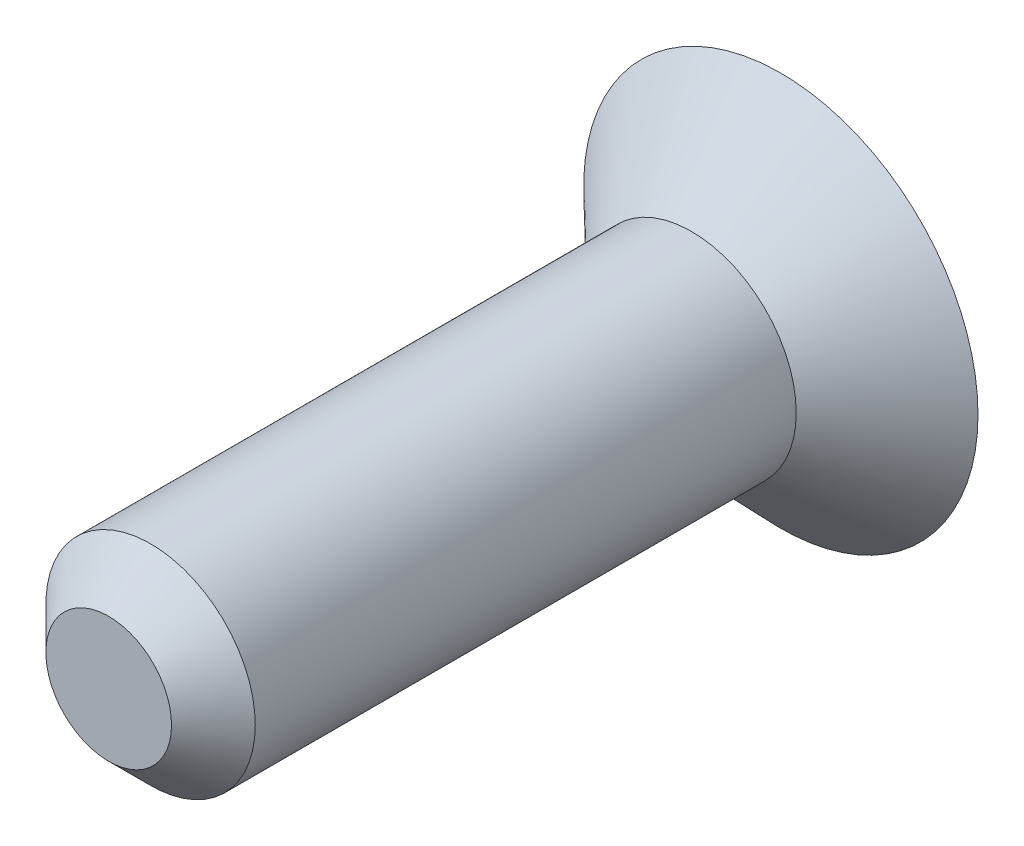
ISO-10303-21;
HEADER;
FILE_DESCRIPTION(('STEP AP214'),'2;1');
FILE_NAME('part.step','',(''),(''),'','','');
FILE_SCHEMA(('AUTOMOTIVE_DESIGN { 1 0 10303 214 1 1 1 1 }'));
ENDSEC;
DATA;
#1=APPLICATION_CONTEXT('core data for automotive mechanical design processes');
#2=APPLICATION_PROTOCOL_DEFINITION('international standard','automotive_design',2000,#1);
#3=PRODUCT_CONTEXT('',#1,'mechanical');
#4=PRODUCT('Part','Part','',(#3));
#5=PRODUCT_RELATED_PRODUCT_CATEGORY('part','',(#4));
#6=PRODUCT_DEFINITION_FORMATION('','',#4);
#7=PRODUCT_DEFINITION_CONTEXT('part definition',#1,'design');
#8=PRODUCT_DEFINITION('design','',#6,#7);
#9=PRODUCT_DEFINITION_SHAPE('','',#8);
#10=(LENGTH_UNIT() NAMED_UNIT(*) SI_UNIT(.MILLI.,.METRE.));
#11=(NAMED_UNIT(*) PLANE_ANGLE_UNIT() SI_UNIT($,.RADIAN.));
#12=(NAMED_UNIT(*) SI_UNIT($,.STERADIAN.) SOLID_ANGLE_UNIT());
#13=UNCERTAINTY_MEASURE_WITH_UNIT(LENGTH_MEASURE(1.E-05),#10,'distance_accuracy_value','');
#14=(GEOMETRIC_REPRESENTATION_CONTEXT(3) GLOBAL_UNCERTAINTY_ASSIGNED_CONTEXT((#13)) GLOBAL_UNIT_ASSIGNED_CONTEXT((#10,
#11,#12)) REPRESENTATION_CONTEXT('',''));
#15=CARTESIAN_POINT('',(0.,0.,0.));
#16=DIRECTION('',(0.,0.,1.));
#17=DIRECTION('',(1.,0.,0.));
#18=AXIS2_PLACEMENT_3D('',#15,#16,#17);
#19=CARTESIAN_POINT('',(0.,0.,-2.55907525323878));
#20=DIRECTION('',(0.,0.,-1.));
#21=DIRECTION('',(-1.,0.,0.));
#22=AXIS2_PLACEMENT_3D('',#19,#20,#21);
#23=PLANE('',#22);
#24=CARTESIAN_POINT('',(0.,0.,-2.55907525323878));
#25=DIRECTION('',(0.,0.,1.));
#26=DIRECTION('',(1.,0.,0.));
#27=AXIS2_PLACEMENT_3D('',#24,#25,#26);
#28=CIRCLE('',#27,5.65);
#29=CARTESIAN_POINT('',(5.65,0.,-2.55907525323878));
#30=VERTEX_POINT('',#29);
#31=EDGE_CURVE('E438',#30,#30,#28,.T.);
#32=ORIENTED_EDGE('',*,*,#31,.F.);
#33=EDGE_LOOP('',(#32));
#34=FACE_BOUND('',#33,.T.);
#35=DIRECTION('',(0.,1.,0.));
#36=VECTOR('',#35,1.);
#37=CARTESIAN_POINT('',(2.,-1.15470053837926,-2.55907525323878));
#38=LINE('',#37,#36);
#39=CARTESIAN_POINT('',(2.,-1.15470053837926,-2.55907525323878));
#40=VERTEX_POINT('',#39);
#41=CARTESIAN_POINT('',(2.,1.15470053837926,-2.55907525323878));
#42=VERTEX_POINT('',#41);
#43=EDGE_CURVE('E419',#40,#42,#38,.T.);
#44=ORIENTED_EDGE('',*,*,#43,.T.);
#45=DIRECTION('',(-0.86602540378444,0.499999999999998,0.));
#46=VECTOR('',#45,1.);
#47=CARTESIAN_POINT('',(0.,2.30940107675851,-2.55907525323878));
#48=LINE('',#47,#46);
#49=CARTESIAN_POINT('',(0.,2.30940107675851,-2.55907525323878));
#50=VERTEX_POINT('',#49);
#51=EDGE_CURVE('E365',#42,#50,#48,.T.);
#52=ORIENTED_EDGE('',*,*,#51,.T.);
#53=DIRECTION('',(-0.866025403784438,-0.500000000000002,0.));
#54=VECTOR('',#53,1.);
#55=CARTESIAN_POINT('',(-2.,1.15470053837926,-2.55907525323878));
#56=LINE('',#55,#54);
#57=CARTESIAN_POINT('',(-2.,1.15470053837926,-2.55907525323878));
#58=VERTEX_POINT('',#57);
#59=EDGE_CURVE('E550',#50,#58,#56,.T.);
#60=ORIENTED_EDGE('',*,*,#59,.T.);
#61=DIRECTION('',(0.,-1.,0.));
#62=VECTOR('',#61,1.);
#63=CARTESIAN_POINT('',(-2.,-1.15470053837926,-2.55907525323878));
#64=LINE('',#63,#62);
#65=CARTESIAN_POINT('',(-2.,-1.15470053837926,-2.55907525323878));
#66=VERTEX_POINT('',#65);
#67=EDGE_CURVE('E548',#58,#66,#64,.T.);
#68=ORIENTED_EDGE('',*,*,#67,.T.);
#69=DIRECTION('',(0.866025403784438,-0.500000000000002,0.));
#70=VECTOR('',#69,1.);
#71=CARTESIAN_POINT('',(-2.,-1.15470053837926,-2.55907525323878));
#72=LINE('',#71,#70);
#73=CARTESIAN_POINT('',(0.,-2.30940107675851,-2.55907525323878));
#74=VERTEX_POINT('',#73);
#75=EDGE_CURVE('E540',#66,#74,#72,.T.);
#76=ORIENTED_EDGE('',*,*,#75,.T.);
#77=DIRECTION('',(0.86602540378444,0.499999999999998,0.));
#78=VECTOR('',#77,1.);
#79=CARTESIAN_POINT('',(0.,-2.30940107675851,-2.55907525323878));
#80=LINE('',#79,#78);
#81=EDGE_CURVE('E544',#74,#40,#80,.T.);
#82=ORIENTED_EDGE('',*,*,#81,.T.);
#83=EDGE_LOOP('',(#44,#52,#60,#68,#76,#82));
#84=FACE_BOUND('',#83,.T.);
#85=ADVANCED_FACE('F350',(#34,#84),#23,.T.);
#86=CARTESIAN_POINT('',(0.,0.,0.));
#87=DIRECTION('',(0.,0.,-1.));
#88=DIRECTION('',(-1.,0.,0.));
#89=AXIS2_PLACEMENT_3D('',#86,#87,#88);
#90=CONICAL_SURFACE('',#89,3.,0.802851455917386);
#91=ORIENTED_EDGE('',*,*,#31,.T.);
#92=EDGE_LOOP('',(#91));
#93=FACE_BOUND('',#92,.T.);
#94=CARTESIAN_POINT('',(0.,0.,0.));
#95=DIRECTION('',(0.,0.,1.));
#96=DIRECTION('',(1.,0.,0.));
#97=AXIS2_PLACEMENT_3D('',#94,#95,#96);
#98=CIRCLE('',#97,3.);
#99=CARTESIAN_POINT('',(3.,0.,0.));
#100=VERTEX_POINT('',#99);
#101=EDGE_CURVE('E441',#100,#100,#98,.T.);
#102=ORIENTED_EDGE('',*,*,#101,.F.);
#103=EDGE_LOOP('',(#102));
#104=FACE_BOUND('',#103,.T.);
#105=ADVANCED_FACE('F352',(#93,#104),#90,.T.);
#106=CARTESIAN_POINT('',(0.,2.30940107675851,0.240924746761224));
#107=DIRECTION('',(-0.499999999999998,-0.86602540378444,0.));
#108=DIRECTION('',(0.86602540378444,-0.499999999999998,0.));
#109=AXIS2_PLACEMENT_3D('',#106,#107,#108);
#110=PLANE('',#109);
#111=DIRECTION('',(0.,0.,-1.));
#112=VECTOR('',#111,1.);
#113=CARTESIAN_POINT('',(0.,2.30940107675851,0.240924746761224));
#114=LINE('',#113,#112);
#115=CARTESIAN_POINT('',(0.,2.30940107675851,0.));
#116=VERTEX_POINT('',#115);
#117=EDGE_CURVE('E425',#116,#50,#114,.T.);
#118=ORIENTED_EDGE('',*,*,#117,.T.);
#119=ORIENTED_EDGE('',*,*,#51,.F.);
#120=DIRECTION('',(0.,0.,-1.));
#121=VECTOR('',#120,1.);
#122=CARTESIAN_POINT('',(2.,1.15470053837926,0.240924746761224));
#123=LINE('',#122,#121);
#124=CARTESIAN_POINT('',(2.,1.15470053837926,0.));
#125=VERTEX_POINT('',#124);
#126=EDGE_CURVE('E421',#125,#42,#123,.T.);
#127=ORIENTED_EDGE('',*,*,#126,.F.);
#128=DIRECTION('',(0.86602540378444,-0.499999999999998,0.));
#129=VECTOR('',#128,1.);
#130=CARTESIAN_POINT('',(0.999999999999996,1.73205080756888,0.));
#131=LINE('',#130,#129);
#132=EDGE_CURVE('E370',#116,#125,#131,.T.);
#133=ORIENTED_EDGE('',*,*,#132,.F.);
#134=EDGE_LOOP('',(#118,#119,#127,#133));
#135=FACE_BOUND('',#134,.T.);
#136=ADVANCED_FACE('F463',(#135),#110,.T.);
#137=CARTESIAN_POINT('',(-2.,1.15470053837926,0.240924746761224));
#138=DIRECTION('',(0.500000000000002,-0.866025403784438,0.));
#139=DIRECTION('',(0.866025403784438,0.500000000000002,0.));
#140=AXIS2_PLACEMENT_3D('',#137,#138,#139);
#141=PLANE('',#140);
#142=DIRECTION('',(0.,0.,-1.));
#143=VECTOR('',#142,1.);
#144=CARTESIAN_POINT('',(-2.,1.15470053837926,0.240924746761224));
#145=LINE('',#144,#143);
#146=CARTESIAN_POINT('',(-2.,1.15470053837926,0.));
#147=VERTEX_POINT('',#146);
#148=EDGE_CURVE('E427',#147,#58,#145,.T.);
#149=ORIENTED_EDGE('',*,*,#148,.T.);
#150=ORIENTED_EDGE('',*,*,#59,.F.);
#151=ORIENTED_EDGE('',*,*,#117,.F.);
#152=DIRECTION('',(0.866025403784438,0.500000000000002,0.));
#153=VECTOR('',#152,1.);
#154=CARTESIAN_POINT('',(-1.00000000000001,1.73205080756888,0.));
#155=LINE('',#154,#153);
#156=EDGE_CURVE('E435',#147,#116,#155,.T.);
#157=ORIENTED_EDGE('',*,*,#156,.F.);
#158=EDGE_LOOP('',(#149,#150,#151,#157));
#159=FACE_BOUND('',#158,.T.);
#160=ADVANCED_FACE('F470',(#159),#141,.T.);
#161=CARTESIAN_POINT('',(-2.,-1.15470053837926,0.240924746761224));
#162=DIRECTION('',(1.,0.,0.));
#163=DIRECTION('',(0.,0.,-1.));
#164=AXIS2_PLACEMENT_3D('',#161,#162,#163);
#165=PLANE('',#164);
#166=DIRECTION('',(0.,0.,-1.));
#167=VECTOR('',#166,1.);
#168=CARTESIAN_POINT('',(-2.,-1.15470053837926,0.240924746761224));
#169=LINE('',#168,#167);
#170=CARTESIAN_POINT('',(-2.,-1.15470053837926,0.));
#171=VERTEX_POINT('',#170);
#172=EDGE_CURVE('E542',#171,#66,#169,.T.);
#173=ORIENTED_EDGE('',*,*,#172,.T.);
#174=ORIENTED_EDGE('',*,*,#67,.F.);
#175=ORIENTED_EDGE('',*,*,#148,.F.);
#176=DIRECTION('',(0.,1.,0.));
#177=VECTOR('',#176,1.);
#178=CARTESIAN_POINT('',(-2.,0.,0.));
#179=LINE('',#178,#177);
#180=EDGE_CURVE('E432',#171,#147,#179,.T.);
#181=ORIENTED_EDGE('',*,*,#180,.F.);
#182=EDGE_LOOP('',(#173,#174,#175,#181));
#183=FACE_BOUND('',#182,.T.);
#184=ADVANCED_FACE('F473',(#183),#165,.T.);
#185=CARTESIAN_POINT('',(-2.,-1.15470053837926,0.240924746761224));
#186=DIRECTION('',(0.500000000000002,0.866025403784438,0.));
#187=DIRECTION('',(-0.866025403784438,0.500000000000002,0.));
#188=AXIS2_PLACEMENT_3D('',#185,#186,#187);
#189=PLANE('',#188);
#190=DIRECTION('',(0.,0.,-1.));
#191=VECTOR('',#190,1.);
#192=CARTESIAN_POINT('',(0.,-2.30940107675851,0.240924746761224));
#193=LINE('',#192,#191);
#194=CARTESIAN_POINT('',(0.,-2.30940107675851,0.));
#195=VERTEX_POINT('',#194);
#196=EDGE_CURVE('E409',#195,#74,#193,.T.);
#197=ORIENTED_EDGE('',*,*,#196,.T.);
#198=ORIENTED_EDGE('',*,*,#75,.F.);
#199=ORIENTED_EDGE('',*,*,#172,.F.);
#200=DIRECTION('',(-0.866025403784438,0.500000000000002,0.));
#201=VECTOR('',#200,1.);
#202=CARTESIAN_POINT('',(-1.00000000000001,-1.73205080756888,0.));
#203=LINE('',#202,#201);
#204=EDGE_CURVE('E413',#195,#171,#203,.T.);
#205=ORIENTED_EDGE('',*,*,#204,.F.);
#206=EDGE_LOOP('',(#197,#198,#199,#205));
#207=FACE_BOUND('',#206,.T.);
#208=ADVANCED_FACE('F477',(#207),#189,.T.);
#209=CARTESIAN_POINT('',(0.,-2.30940107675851,0.240924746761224));
#210=DIRECTION('',(-0.499999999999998,0.86602540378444,0.));
#211=DIRECTION('',(-0.86602540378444,-0.499999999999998,0.));
#212=AXIS2_PLACEMENT_3D('',#209,#210,#211);
#213=PLANE('',#212);
#214=DIRECTION('',(0.,0.,-1.));
#215=VECTOR('',#214,1.);
#216=CARTESIAN_POINT('',(2.,-1.15470053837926,0.240924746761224));
#217=LINE('',#216,#215);
#218=CARTESIAN_POINT('',(2.,-1.15470053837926,0.));
#219=VERTEX_POINT('',#218);
#220=EDGE_CURVE('E407',#219,#40,#217,.T.);
#221=ORIENTED_EDGE('',*,*,#220,.T.);
#222=ORIENTED_EDGE('',*,*,#81,.F.);
#223=ORIENTED_EDGE('',*,*,#196,.F.);
#224=DIRECTION('',(-0.86602540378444,-0.499999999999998,0.));
#225=VECTOR('',#224,1.);
#226=CARTESIAN_POINT('',(0.999999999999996,-1.73205080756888,0.));
#227=LINE('',#226,#225);
#228=EDGE_CURVE('E403',#219,#195,#227,.T.);
#229=ORIENTED_EDGE('',*,*,#228,.F.);
#230=EDGE_LOOP('',(#221,#222,#223,#229));
#231=FACE_BOUND('',#230,.T.);
#232=ADVANCED_FACE('F405',(#231),#213,.T.);
#233=CARTESIAN_POINT('',(2.,-1.15470053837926,0.240924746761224));
#234=DIRECTION('',(-1.,0.,0.));
#235=DIRECTION('',(0.,-1.,0.));
#236=AXIS2_PLACEMENT_3D('',#233,#234,#235);
#237=PLANE('',#236);
#238=ORIENTED_EDGE('',*,*,#126,.T.);
#239=ORIENTED_EDGE('',*,*,#43,.F.);
#240=ORIENTED_EDGE('',*,*,#220,.F.);
#241=DIRECTION('',(0.,-1.,0.));
#242=VECTOR('',#241,1.);
#243=CARTESIAN_POINT('',(2.,0.,0.));
#244=LINE('',#243,#242);
#245=EDGE_CURVE('E414',#125,#219,#244,.T.);
#246=ORIENTED_EDGE('',*,*,#245,.F.);
#247=EDGE_LOOP('',(#238,#239,#240,#246));
#248=FACE_BOUND('',#247,.T.);
#249=ADVANCED_FACE('F417',(#248),#237,.T.);
#250=CARTESIAN_POINT('',(0.,0.,0.));
#251=DIRECTION('',(0.,0.,-1.));
#252=DIRECTION('',(-1.,0.,0.));
#253=AXIS2_PLACEMENT_3D('',#250,#251,#252);
#254=PLANE('',#253);
#255=ORIENTED_EDGE('',*,*,#156,.T.);
#256=ORIENTED_EDGE('',*,*,#132,.T.);
#257=ORIENTED_EDGE('',*,*,#245,.T.);
#258=ORIENTED_EDGE('',*,*,#228,.T.);
#259=ORIENTED_EDGE('',*,*,#204,.T.);
#260=ORIENTED_EDGE('',*,*,#180,.T.);
#261=EDGE_LOOP('',(#255,#256,#257,#258,#259,#260));
#262=FACE_BOUND('',#261,.T.);
#263=ADVANCED_FACE('F424',(#262),#254,.T.);
#264=CARTESIAN_POINT('',(0.,0.,0.));
#265=DIRECTION('',(0.,0.,1.));
#266=DIRECTION('',(1.,0.,0.));
#267=AXIS2_PLACEMENT_3D('',#264,#265,#266);
#268=CYLINDRICAL_SURFACE('',#267,3.);
#269=CARTESIAN_POINT('',(0.,0.,15.5));
#270=DIRECTION('',(0.,0.,1.));
#271=DIRECTION('',(1.,0.,0.));
#272=AXIS2_PLACEMENT_3D('',#269,#270,#271);
#273=CIRCLE('',#272,3.);
#274=CARTESIAN_POINT('',(3.,0.,15.5));
#275=VERTEX_POINT('',#274);
#276=EDGE_CURVE('E11',#275,#275,#273,.F.);
#277=ORIENTED_EDGE('',*,*,#276,.T.);
#278=EDGE_LOOP('',(#277));
#279=FACE_BOUND('',#278,.T.);
#280=ORIENTED_EDGE('',*,*,#101,.T.);
#281=EDGE_LOOP('',(#280));
#282=FACE_BOUND('',#281,.T.);
#283=ADVANCED_FACE('F455',(#279,#282),#268,.T.);
#284=CARTESIAN_POINT('',(0.,0.,16.7));
#285=DIRECTION('',(0.,0.,1.));
#286=DIRECTION('',(1.,0.,0.));
#287=AXIS2_PLACEMENT_3D('',#284,#285,#286);
#288=PLANE('',#287);
#289=CARTESIAN_POINT('',(0.,0.,16.7));
#290=DIRECTION('',(0.,0.,1.));
#291=DIRECTION('',(1.,0.,0.));
#292=AXIS2_PLACEMENT_3D('',#289,#290,#291);
#293=CIRCLE('',#292,1.79999999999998);
#294=CARTESIAN_POINT('',(1.79999999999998,0.,16.7));
#295=VERTEX_POINT('',#294);
#296=EDGE_CURVE('E358',#295,#295,#293,.T.);
#297=ORIENTED_EDGE('',*,*,#296,.T.);
#298=EDGE_LOOP('',(#297));
#299=FACE_BOUND('',#298,.T.);
#300=ADVANCED_FACE('F446',(#299),#288,.T.);
#301=CARTESIAN_POINT('',(0.,0.,16.7));
#302=DIRECTION('',(0.,0.,-1.));
#303=DIRECTION('',(-1.,0.,0.));
#304=AXIS2_PLACEMENT_3D('',#301,#302,#303);
#305=CONICAL_SURFACE('',#304,1.79999999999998,0.785398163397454);
#306=ORIENTED_EDGE('',*,*,#276,.F.);
#307=EDGE_LOOP('',(#306));
#308=FACE_BOUND('',#307,.T.);
#309=ORIENTED_EDGE('',*,*,#296,.F.);
#310=EDGE_LOOP('',(#309));
#311=FACE_BOUND('',#310,.T.);
#312=ADVANCED_FACE('F448',(#308,#311),#305,.T.);
#313=CLOSED_SHELL('',(#85,#105,#136,#160,#184,#208,#232,#249,#263,#283,#300,#312));
#314=MANIFOLD_SOLID_BREP('B2',#313);
#315=ADVANCED_BREP_SHAPE_REPRESENTATION('',(#18,#314),#14);
#316=SHAPE_DEFINITION_REPRESENTATION(#9,#315);
ENDSEC;
END-ISO-10303-21;
